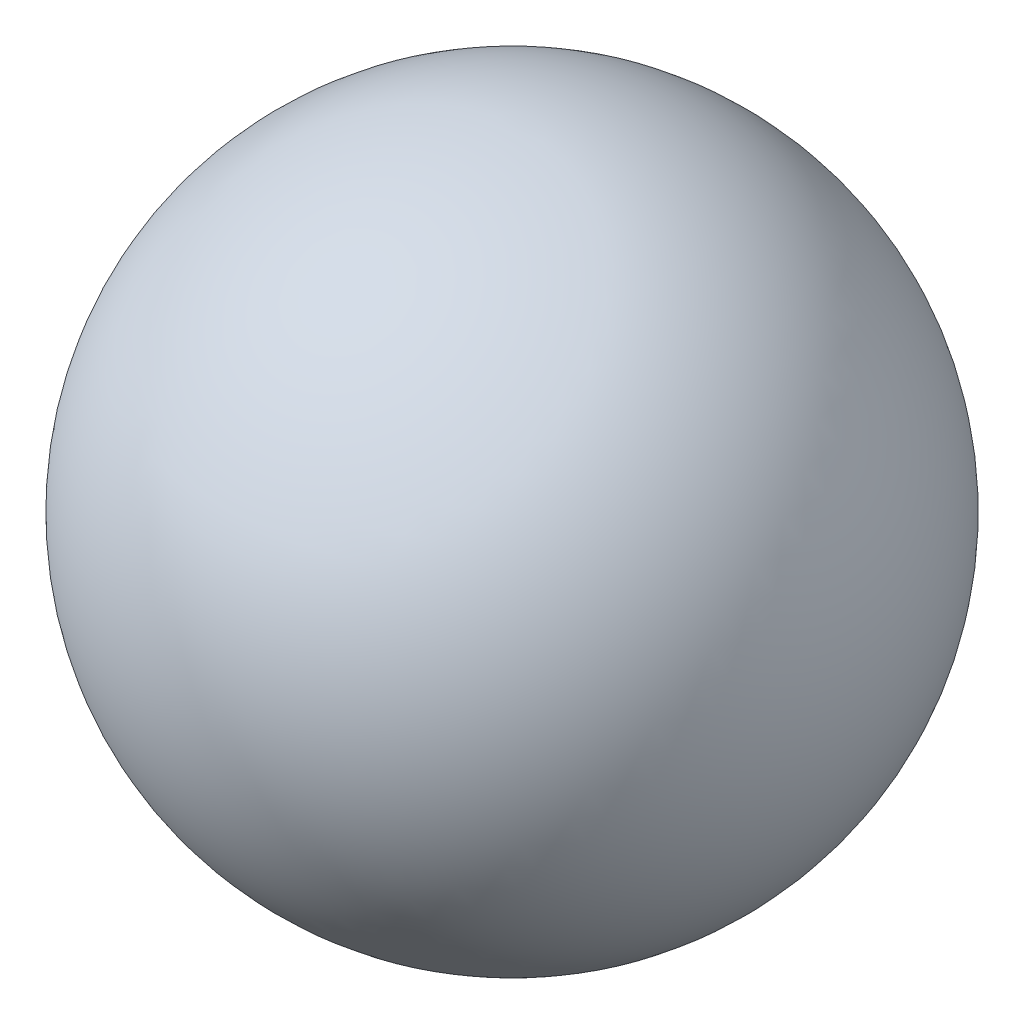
from build123d import *
from build123d.topology import SkipClean


with BuildPart() as part:
    # Sketch1 → Revolve1 (revolve)
    with SkipClean():  # the faces are left unmerged after this step: merging them gives an invalid solid
        with BuildSketch(Plane.XY):
            with BuildLine():
                ThreePointArc((3, 0), (2.121320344, 2.121320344), (0, 3))
                Line((0, 3), (0, -3))
                ThreePointArc((0, -3), (2.121320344, -2.121320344), (3, 0))
            make_face()
            with BuildLine():
                Line((0, -3), (0, 3))
                ThreePointArc((0, 3), (-3, 0), (0, -3))
            make_face()
        revolve(axis=Axis((0, 3, 0), (0, -1, 0)))


solid = part.part
